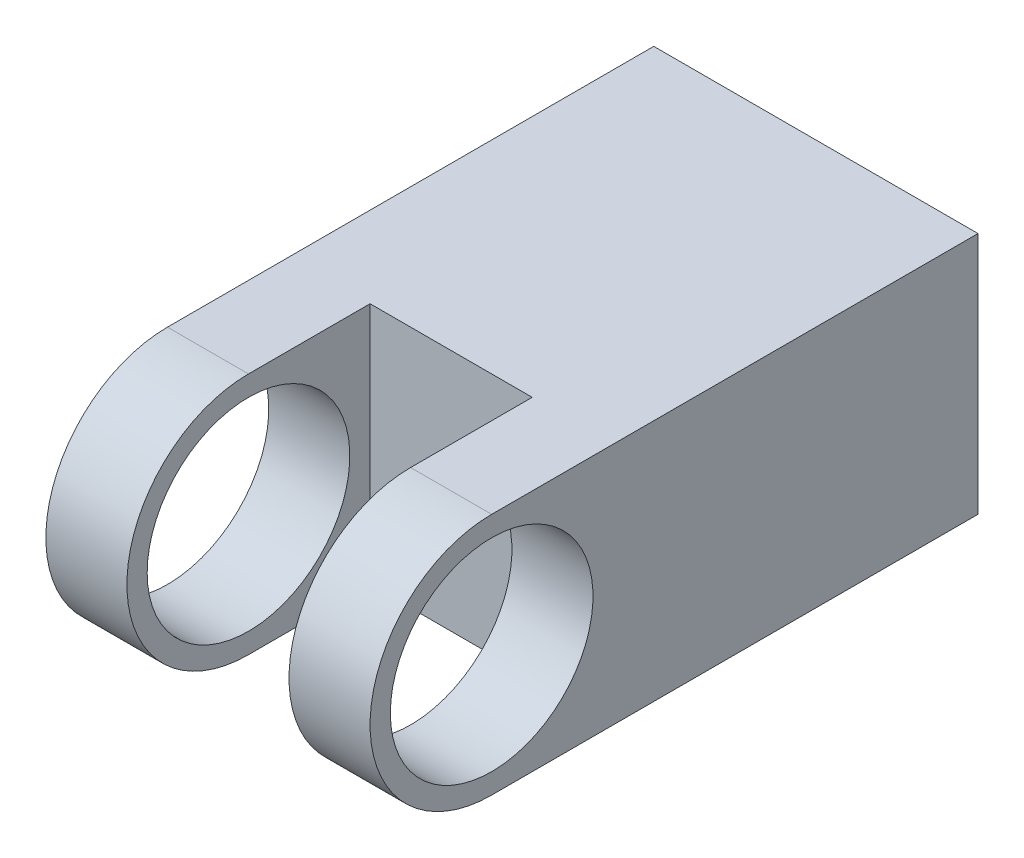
from build123d import *

# Parameters (mm, degrees)
SKETCH1_W           = 40
SKETCH1_H           = 45
BOSS_EXTRUDE1_DEPTH = 30
SKETCH2_R           = 12.5
BOSS_EXTRUDE2_DEPTH = 10


with BuildPart() as part:
    # Sketch1 → Boss-Extrude1 (new body)
    with BuildSketch(Plane(origin=(0, 0, 0), x_dir=(1, 0, 0), z_dir=(0, 1, 0))):
        with Locations((20, 22.5)):
            Rectangle(SKETCH1_W, SKETCH1_H)
    extrude(amount=BOSS_EXTRUDE1_DEPTH)

    # Sketch2 → Boss-Extrude2 (add)
    with BuildSketch(Plane.ZY):
        with BuildLine():
            Line((0, 30), (15, 30))
            ThreePointArc((15, 30), (30, 15), (15, 0))
            Line((15, 0), (0, 0))
            Line((0, 0), (0, 30))
        make_face()
        with Locations((15, 15)):
            Circle(SKETCH2_R, mode=Mode.SUBTRACT)
    boss_extrude2 = extrude(amount=-BOSS_EXTRUDE2_DEPTH)

    # Mirror1: Boss-Extrude2 across plane
    add(boss_extrude2.mirror(Plane(origin=(20, 0, 0), x_dir=(0, 0, 1), z_dir=(1, 0, 0))))


solid = part.part
